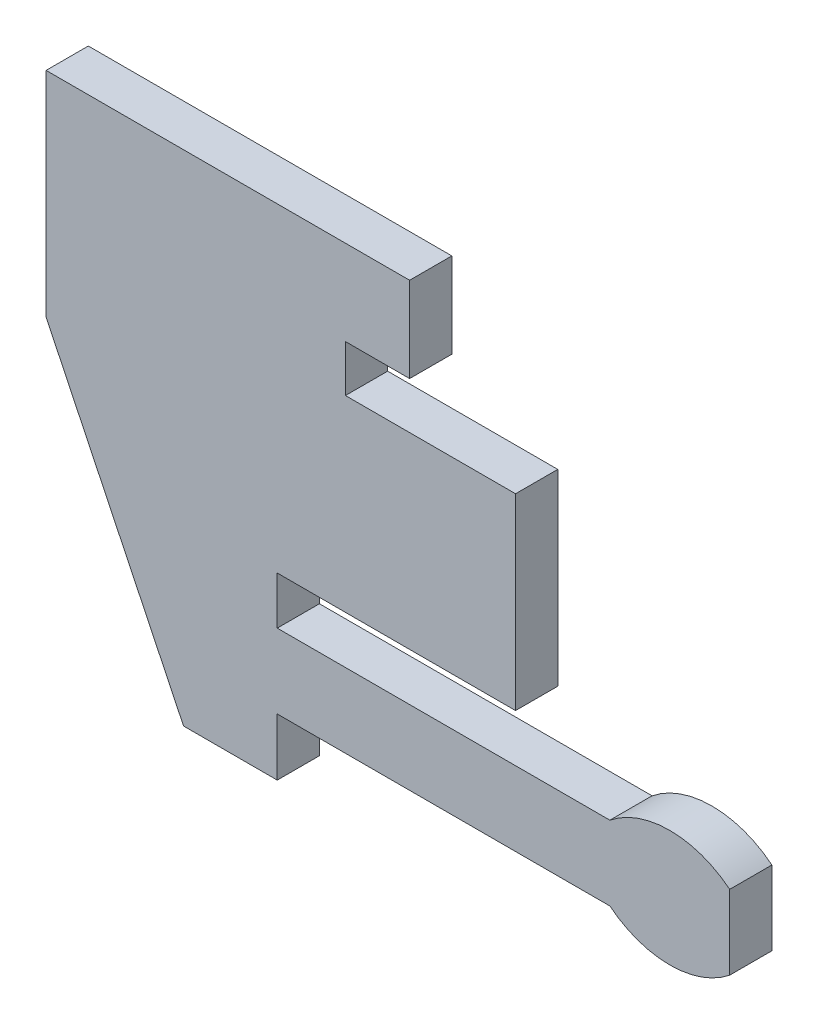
ISO-10303-21;
HEADER;
FILE_DESCRIPTION(('STEP AP214'),'2;1');
FILE_NAME('part.step','',(''),(''),'','','');
FILE_SCHEMA(('AUTOMOTIVE_DESIGN { 1 0 10303 214 1 1 1 1 }'));
ENDSEC;
DATA;
#1=APPLICATION_CONTEXT('core data for automotive mechanical design processes');
#2=APPLICATION_PROTOCOL_DEFINITION('international standard','automotive_design',2000,#1);
#3=PRODUCT_CONTEXT('',#1,'mechanical');
#4=PRODUCT('Part','Part','',(#3));
#5=PRODUCT_RELATED_PRODUCT_CATEGORY('part','',(#4));
#6=PRODUCT_DEFINITION_FORMATION('','',#4);
#7=PRODUCT_DEFINITION_CONTEXT('part definition',#1,'design');
#8=PRODUCT_DEFINITION('design','',#6,#7);
#9=PRODUCT_DEFINITION_SHAPE('','',#8);
#10=(LENGTH_UNIT() NAMED_UNIT(*) SI_UNIT(.MILLI.,.METRE.));
#11=(NAMED_UNIT(*) PLANE_ANGLE_UNIT() SI_UNIT($,.RADIAN.));
#12=(NAMED_UNIT(*) SI_UNIT($,.STERADIAN.) SOLID_ANGLE_UNIT());
#13=UNCERTAINTY_MEASURE_WITH_UNIT(LENGTH_MEASURE(1.E-05),#10,'distance_accuracy_value','');
#14=(GEOMETRIC_REPRESENTATION_CONTEXT(3) GLOBAL_UNCERTAINTY_ASSIGNED_CONTEXT((#13)) GLOBAL_UNIT_ASSIGNED_CONTEXT((#10,
#11,#12)) REPRESENTATION_CONTEXT('',''));
#15=CARTESIAN_POINT('',(0.,0.,0.));
#16=DIRECTION('',(0.,0.,1.));
#17=DIRECTION('',(1.,0.,0.));
#18=AXIS2_PLACEMENT_3D('',#15,#16,#17);
#19=CARTESIAN_POINT('',(-6.49853117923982,0.164170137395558,1.524));
#20=DIRECTION('',(0.,1.,0.));
#21=DIRECTION('',(0.,0.,1.));
#22=AXIS2_PLACEMENT_3D('',#19,#20,#21);
#23=PLANE('',#22);
#24=DIRECTION('',(1.,0.,0.));
#25=VECTOR('',#24,1.);
#26=CARTESIAN_POINT('',(-6.49853117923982,0.164170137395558,0.));
#27=LINE('',#26,#25);
#28=CARTESIAN_POINT('',(-8.81542456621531,0.164170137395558,0.));
#29=VERTEX_POINT('',#28);
#30=CARTESIAN_POINT('',(-6.49853117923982,0.164170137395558,0.));
#31=VERTEX_POINT('',#30);
#32=EDGE_CURVE('E186',#29,#31,#27,.T.);
#33=ORIENTED_EDGE('',*,*,#32,.T.);
#34=DIRECTION('',(0.,0.,-1.));
#35=VECTOR('',#34,1.);
#36=CARTESIAN_POINT('',(-6.49853117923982,0.164170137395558,1.524));
#37=LINE('',#36,#35);
#38=CARTESIAN_POINT('',(-6.49853117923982,0.164170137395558,1.524));
#39=VERTEX_POINT('',#38);
#40=EDGE_CURVE('E11',#39,#31,#37,.T.);
#41=ORIENTED_EDGE('',*,*,#40,.F.);
#42=DIRECTION('',(1.,0.,0.));
#43=VECTOR('',#42,1.);
#44=CARTESIAN_POINT('',(-6.49853117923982,0.164170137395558,1.524));
#45=LINE('',#44,#43);
#46=CARTESIAN_POINT('',(-8.81542456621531,0.164170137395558,1.524));
#47=VERTEX_POINT('',#46);
#48=EDGE_CURVE('E218',#47,#39,#45,.T.);
#49=ORIENTED_EDGE('',*,*,#48,.F.);
#50=DIRECTION('',(0.,0.,-1.));
#51=VECTOR('',#50,1.);
#52=CARTESIAN_POINT('',(-8.81542456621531,0.164170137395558,1.524));
#53=LINE('',#52,#51);
#54=EDGE_CURVE('E182',#47,#29,#53,.T.);
#55=ORIENTED_EDGE('',*,*,#54,.T.);
#56=EDGE_LOOP('',(#33,#41,#49,#55));
#57=FACE_BOUND('',#56,.T.);
#58=ADVANCED_FACE('F36',(#57),#23,.F.);
#59=CARTESIAN_POINT('',(-6.49853117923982,3.2394890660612,1.524));
#60=DIRECTION('',(-1.,0.,0.));
#61=DIRECTION('',(0.,0.,1.));
#62=AXIS2_PLACEMENT_3D('',#59,#60,#61);
#63=PLANE('',#62);
#64=DIRECTION('',(0.,1.,0.));
#65=VECTOR('',#64,1.);
#66=CARTESIAN_POINT('',(-6.49853117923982,3.2394890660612,0.));
#67=LINE('',#66,#65);
#68=CARTESIAN_POINT('',(-6.49853117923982,3.2394890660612,0.));
#69=VERTEX_POINT('',#68);
#70=EDGE_CURVE('E189',#31,#69,#67,.T.);
#71=ORIENTED_EDGE('',*,*,#70,.T.);
#72=DIRECTION('',(0.,0.,-1.));
#73=VECTOR('',#72,1.);
#74=CARTESIAN_POINT('',(-6.49853117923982,3.2394890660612,1.524));
#75=LINE('',#74,#73);
#76=CARTESIAN_POINT('',(-6.49853117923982,3.2394890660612,1.524));
#77=VERTEX_POINT('',#76);
#78=EDGE_CURVE('E44',#77,#69,#75,.T.);
#79=ORIENTED_EDGE('',*,*,#78,.F.);
#80=DIRECTION('',(0.,1.,0.));
#81=VECTOR('',#80,1.);
#82=CARTESIAN_POINT('',(-6.49853117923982,3.2394890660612,1.524));
#83=LINE('',#82,#81);
#84=EDGE_CURVE('E122',#39,#77,#83,.T.);
#85=ORIENTED_EDGE('',*,*,#84,.F.);
#86=ORIENTED_EDGE('',*,*,#40,.T.);
#87=EDGE_LOOP('',(#71,#79,#85,#86));
#88=FACE_BOUND('',#87,.T.);
#89=ADVANCED_FACE('F321',(#88),#63,.F.);
#90=CARTESIAN_POINT('',(-19.6239910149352,3.2394890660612,1.524));
#91=DIRECTION('',(0.,-1.,0.));
#92=DIRECTION('',(0.,0.,-1.));
#93=AXIS2_PLACEMENT_3D('',#90,#91,#92);
#94=PLANE('',#93);
#95=DIRECTION('',(-1.,0.,0.));
#96=VECTOR('',#95,1.);
#97=CARTESIAN_POINT('',(-19.6239910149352,3.2394890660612,0.));
#98=LINE('',#97,#96);
#99=CARTESIAN_POINT('',(-19.6239910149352,3.2394890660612,0.));
#100=VERTEX_POINT('',#99);
#101=EDGE_CURVE('E191',#69,#100,#98,.T.);
#102=ORIENTED_EDGE('',*,*,#101,.T.);
#103=DIRECTION('',(0.,0.,-1.));
#104=VECTOR('',#103,1.);
#105=CARTESIAN_POINT('',(-19.6239910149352,3.2394890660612,1.524));
#106=LINE('',#105,#104);
#107=CARTESIAN_POINT('',(-19.6239910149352,3.2394890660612,1.524));
#108=VERTEX_POINT('',#107);
#109=EDGE_CURVE('E252',#108,#100,#106,.T.);
#110=ORIENTED_EDGE('',*,*,#109,.F.);
#111=DIRECTION('',(-1.,0.,0.));
#112=VECTOR('',#111,1.);
#113=CARTESIAN_POINT('',(-19.6239910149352,3.2394890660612,1.524));
#114=LINE('',#113,#112);
#115=EDGE_CURVE('E260',#77,#108,#114,.T.);
#116=ORIENTED_EDGE('',*,*,#115,.F.);
#117=ORIENTED_EDGE('',*,*,#78,.T.);
#118=EDGE_LOOP('',(#102,#110,#116,#117));
#119=FACE_BOUND('',#118,.T.);
#120=ADVANCED_FACE('F258',(#119),#94,.F.);
#121=CARTESIAN_POINT('',(-19.6239910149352,-4.47575270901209,1.524));
#122=DIRECTION('',(1.,0.,0.));
#123=DIRECTION('',(0.,0.,-1.));
#124=AXIS2_PLACEMENT_3D('',#121,#122,#123);
#125=PLANE('',#124);
#126=DIRECTION('',(0.,-1.,0.));
#127=VECTOR('',#126,1.);
#128=CARTESIAN_POINT('',(-19.6239910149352,-4.47575270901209,0.));
#129=LINE('',#128,#127);
#130=CARTESIAN_POINT('',(-19.6239910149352,-4.47575270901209,0.));
#131=VERTEX_POINT('',#130);
#132=EDGE_CURVE('E193',#100,#131,#129,.T.);
#133=ORIENTED_EDGE('',*,*,#132,.T.);
#134=DIRECTION('',(0.,0.,-1.));
#135=VECTOR('',#134,1.);
#136=CARTESIAN_POINT('',(-19.6239910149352,-4.47575270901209,1.524));
#137=LINE('',#136,#135);
#138=CARTESIAN_POINT('',(-19.6239910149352,-4.47575270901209,1.524));
#139=VERTEX_POINT('',#138);
#140=EDGE_CURVE('E249',#139,#131,#137,.T.);
#141=ORIENTED_EDGE('',*,*,#140,.F.);
#142=DIRECTION('',(0.,-1.,0.));
#143=VECTOR('',#142,1.);
#144=CARTESIAN_POINT('',(-19.6239910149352,-4.47575270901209,1.524));
#145=LINE('',#144,#143);
#146=EDGE_CURVE('E278',#108,#139,#145,.T.);
#147=ORIENTED_EDGE('',*,*,#146,.F.);
#148=ORIENTED_EDGE('',*,*,#109,.T.);
#149=EDGE_LOOP('',(#133,#141,#147,#148));
#150=FACE_BOUND('',#149,.T.);
#151=ADVANCED_FACE('F269',(#150),#125,.F.);
#152=CARTESIAN_POINT('',(-14.6613021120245,-14.7809780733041,1.524));
#153=DIRECTION('',(0.900970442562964,0.433880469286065,0.));
#154=DIRECTION('',(-0.433880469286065,0.900970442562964,0.));
#155=AXIS2_PLACEMENT_3D('',#152,#153,#154);
#156=PLANE('',#155);
#157=DIRECTION('',(0.433880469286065,-0.900970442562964,0.));
#158=VECTOR('',#157,1.);
#159=CARTESIAN_POINT('',(-14.6613021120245,-14.7809780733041,0.));
#160=LINE('',#159,#158);
#161=CARTESIAN_POINT('',(-14.6613021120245,-14.7809780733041,0.));
#162=VERTEX_POINT('',#161);
#163=EDGE_CURVE('E195',#131,#162,#160,.T.);
#164=ORIENTED_EDGE('',*,*,#163,.T.);
#165=DIRECTION('',(0.,0.,-1.));
#166=VECTOR('',#165,1.);
#167=CARTESIAN_POINT('',(-14.6613021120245,-14.7809780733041,1.524));
#168=LINE('',#167,#166);
#169=CARTESIAN_POINT('',(-14.6613021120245,-14.7809780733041,1.524));
#170=VERTEX_POINT('',#169);
#171=EDGE_CURVE('E246',#170,#162,#168,.T.);
#172=ORIENTED_EDGE('',*,*,#171,.F.);
#173=DIRECTION('',(0.433880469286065,-0.900970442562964,0.));
#174=VECTOR('',#173,1.);
#175=CARTESIAN_POINT('',(-14.6613021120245,-14.7809780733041,1.524));
#176=LINE('',#175,#174);
#177=EDGE_CURVE('E275',#139,#170,#176,.T.);
#178=ORIENTED_EDGE('',*,*,#177,.F.);
#179=ORIENTED_EDGE('',*,*,#140,.T.);
#180=EDGE_LOOP('',(#164,#172,#178,#179));
#181=FACE_BOUND('',#180,.T.);
#182=ADVANCED_FACE('F273',(#181),#156,.F.);
#183=CARTESIAN_POINT('',(-11.2779648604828,-14.7809780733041,1.524));
#184=DIRECTION('',(0.,1.,0.));
#185=DIRECTION('',(0.,0.,1.));
#186=AXIS2_PLACEMENT_3D('',#183,#184,#185);
#187=PLANE('',#186);
#188=DIRECTION('',(1.,0.,0.));
#189=VECTOR('',#188,1.);
#190=CARTESIAN_POINT('',(-11.2779648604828,-14.7809780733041,0.));
#191=LINE('',#190,#189);
#192=CARTESIAN_POINT('',(-11.2779648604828,-14.7809780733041,0.));
#193=VERTEX_POINT('',#192);
#194=EDGE_CURVE('E197',#162,#193,#191,.T.);
#195=ORIENTED_EDGE('',*,*,#194,.T.);
#196=DIRECTION('',(0.,0.,-1.));
#197=VECTOR('',#196,1.);
#198=CARTESIAN_POINT('',(-11.2779648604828,-14.7809780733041,1.524));
#199=LINE('',#198,#197);
#200=CARTESIAN_POINT('',(-11.2779648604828,-14.7809780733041,1.524));
#201=VERTEX_POINT('',#200);
#202=EDGE_CURVE('E243',#201,#193,#199,.T.);
#203=ORIENTED_EDGE('',*,*,#202,.F.);
#204=DIRECTION('',(1.,0.,0.));
#205=VECTOR('',#204,1.);
#206=CARTESIAN_POINT('',(-11.2779648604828,-14.7809780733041,1.524));
#207=LINE('',#206,#205);
#208=EDGE_CURVE('E277',#170,#201,#207,.T.);
#209=ORIENTED_EDGE('',*,*,#208,.F.);
#210=ORIENTED_EDGE('',*,*,#171,.T.);
#211=EDGE_LOOP('',(#195,#203,#209,#210));
#212=FACE_BOUND('',#211,.T.);
#213=ADVANCED_FACE('F334',(#212),#187,.F.);
#214=CARTESIAN_POINT('',(-11.2779648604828,-12.7117809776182,1.524));
#215=DIRECTION('',(-1.,0.,0.));
#216=DIRECTION('',(0.,0.,1.));
#217=AXIS2_PLACEMENT_3D('',#214,#215,#216);
#218=PLANE('',#217);
#219=DIRECTION('',(0.,1.,0.));
#220=VECTOR('',#219,1.);
#221=CARTESIAN_POINT('',(-11.2779648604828,-12.7117809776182,0.));
#222=LINE('',#221,#220);
#223=CARTESIAN_POINT('',(-11.2779648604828,-12.7117809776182,0.));
#224=VERTEX_POINT('',#223);
#225=EDGE_CURVE('E199',#193,#224,#222,.T.);
#226=ORIENTED_EDGE('',*,*,#225,.T.);
#227=DIRECTION('',(0.,0.,-1.));
#228=VECTOR('',#227,1.);
#229=CARTESIAN_POINT('',(-11.2779648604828,-12.7117809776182,1.524));
#230=LINE('',#229,#228);
#231=CARTESIAN_POINT('',(-11.2779648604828,-12.7117809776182,1.524));
#232=VERTEX_POINT('',#231);
#233=EDGE_CURVE('E240',#232,#224,#230,.T.);
#234=ORIENTED_EDGE('',*,*,#233,.F.);
#235=DIRECTION('',(0.,1.,0.));
#236=VECTOR('',#235,1.);
#237=CARTESIAN_POINT('',(-11.2779648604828,-12.7117809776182,1.524));
#238=LINE('',#237,#236);
#239=EDGE_CURVE('E280',#201,#232,#238,.T.);
#240=ORIENTED_EDGE('',*,*,#239,.F.);
#241=ORIENTED_EDGE('',*,*,#202,.T.);
#242=EDGE_LOOP('',(#226,#234,#240,#241));
#243=FACE_BOUND('',#242,.T.);
#244=ADVANCED_FACE('F337',(#243),#218,.F.);
#245=CARTESIAN_POINT('',(0.731715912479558,-12.7117809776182,1.524));
#246=DIRECTION('',(0.,1.,0.));
#247=DIRECTION('',(0.,0.,1.));
#248=AXIS2_PLACEMENT_3D('',#245,#246,#247);
#249=PLANE('',#248);
#250=DIRECTION('',(1.,0.,0.));
#251=VECTOR('',#250,1.);
#252=CARTESIAN_POINT('',(0.731715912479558,-12.7117809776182,0.));
#253=LINE('',#252,#251);
#254=CARTESIAN_POINT('',(0.731715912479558,-12.7117809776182,0.));
#255=VERTEX_POINT('',#254);
#256=EDGE_CURVE('E201',#224,#255,#253,.T.);
#257=ORIENTED_EDGE('',*,*,#256,.T.);
#258=DIRECTION('',(0.,0.,-1.));
#259=VECTOR('',#258,1.);
#260=CARTESIAN_POINT('',(0.731715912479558,-12.7117809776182,1.524));
#261=LINE('',#260,#259);
#262=CARTESIAN_POINT('',(0.731715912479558,-12.7117809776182,1.524));
#263=VERTEX_POINT('',#262);
#264=EDGE_CURVE('E237',#263,#255,#261,.T.);
#265=ORIENTED_EDGE('',*,*,#264,.F.);
#266=DIRECTION('',(1.,0.,0.));
#267=VECTOR('',#266,1.);
#268=CARTESIAN_POINT('',(0.731715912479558,-12.7117809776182,1.524));
#269=LINE('',#268,#267);
#270=EDGE_CURVE('E286',#232,#263,#269,.T.);
#271=ORIENTED_EDGE('',*,*,#270,.F.);
#272=ORIENTED_EDGE('',*,*,#233,.T.);
#273=EDGE_LOOP('',(#257,#265,#271,#272));
#274=FACE_BOUND('',#273,.T.);
#275=ADVANCED_FACE('F341',(#274),#249,.F.);
#276=CARTESIAN_POINT('',(2.89511691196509,-10.0282288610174,1.524));
#277=DIRECTION('',(0.,0.,-1.));
#278=DIRECTION('',(-1.,0.,0.));
#279=AXIS2_PLACEMENT_3D('',#276,#277,#278);
#280=CYLINDRICAL_SURFACE('',#279,3.44699228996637);
#281=CARTESIAN_POINT('',(2.89511691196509,-10.0282288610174,0.));
#282=DIRECTION('',(0.,0.,1.));
#283=DIRECTION('',(1.,0.,0.));
#284=AXIS2_PLACEMENT_3D('',#281,#282,#283);
#285=CIRCLE('',#284,3.44699228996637);
#286=CARTESIAN_POINT('',(5.05851791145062,-12.7117809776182,0.));
#287=VERTEX_POINT('',#286);
#288=EDGE_CURVE('E203',#255,#287,#285,.T.);
#289=ORIENTED_EDGE('',*,*,#288,.T.);
#290=DIRECTION('',(0.,0.,-1.));
#291=VECTOR('',#290,1.);
#292=CARTESIAN_POINT('',(5.05851791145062,-12.7117809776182,1.524));
#293=LINE('',#292,#291);
#294=CARTESIAN_POINT('',(5.05851791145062,-12.7117809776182,1.524));
#295=VERTEX_POINT('',#294);
#296=EDGE_CURVE('E234',#295,#287,#293,.T.);
#297=ORIENTED_EDGE('',*,*,#296,.F.);
#298=CARTESIAN_POINT('',(2.89511691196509,-10.0282288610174,1.524));
#299=DIRECTION('',(0.,0.,1.));
#300=DIRECTION('',(1.,0.,0.));
#301=AXIS2_PLACEMENT_3D('',#298,#299,#300);
#302=CIRCLE('',#301,3.44699228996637);
#303=EDGE_CURVE('E288',#263,#295,#302,.T.);
#304=ORIENTED_EDGE('',*,*,#303,.F.);
#305=ORIENTED_EDGE('',*,*,#264,.T.);
#306=EDGE_LOOP('',(#289,#297,#304,#305));
#307=FACE_BOUND('',#306,.T.);
#308=ADVANCED_FACE('F345',(#307),#280,.T.);
#309=CARTESIAN_POINT('',(5.05851791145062,-10.0282288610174,1.524));
#310=DIRECTION('',(-1.,0.,0.));
#311=DIRECTION('',(0.,0.,1.));
#312=AXIS2_PLACEMENT_3D('',#309,#310,#311);
#313=PLANE('',#312);
#314=DIRECTION('',(0.,1.,0.));
#315=VECTOR('',#314,1.);
#316=CARTESIAN_POINT('',(5.05851791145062,-10.0282288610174,0.));
#317=LINE('',#316,#315);
#318=CARTESIAN_POINT('',(5.05851791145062,-10.0282288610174,0.));
#319=VERTEX_POINT('',#318);
#320=EDGE_CURVE('E205',#287,#319,#317,.T.);
#321=ORIENTED_EDGE('',*,*,#320,.T.);
#322=DIRECTION('',(0.,0.,-1.));
#323=VECTOR('',#322,1.);
#324=CARTESIAN_POINT('',(5.05851791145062,-10.0282288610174,1.524));
#325=LINE('',#324,#323);
#326=CARTESIAN_POINT('',(5.05851791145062,-10.0282288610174,1.524));
#327=VERTEX_POINT('',#326);
#328=EDGE_CURVE('E231',#327,#319,#325,.T.);
#329=ORIENTED_EDGE('',*,*,#328,.F.);
#330=DIRECTION('',(0.,1.,0.));
#331=VECTOR('',#330,1.);
#332=CARTESIAN_POINT('',(5.05851791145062,-10.0282288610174,1.524));
#333=LINE('',#332,#331);
#334=EDGE_CURVE('E290',#295,#327,#333,.T.);
#335=ORIENTED_EDGE('',*,*,#334,.F.);
#336=ORIENTED_EDGE('',*,*,#296,.T.);
#337=EDGE_LOOP('',(#321,#329,#335,#336));
#338=FACE_BOUND('',#337,.T.);
#339=ADVANCED_FACE('F349',(#338),#313,.F.);
#340=CARTESIAN_POINT('',(2.89511691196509,-12.7117809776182,1.524));
#341=DIRECTION('',(0.,0.,-1.));
#342=DIRECTION('',(-1.,0.,0.));
#343=AXIS2_PLACEMENT_3D('',#340,#341,#342);
#344=CYLINDRICAL_SURFACE('',#343,3.44699228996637);
#345=CARTESIAN_POINT('',(2.89511691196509,-12.7117809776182,0.));
#346=DIRECTION('',(0.,0.,1.));
#347=DIRECTION('',(-1.,0.,0.));
#348=AXIS2_PLACEMENT_3D('',#345,#346,#347);
#349=CIRCLE('',#348,3.44699228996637);
#350=CARTESIAN_POINT('',(0.731715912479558,-10.0282288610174,0.));
#351=VERTEX_POINT('',#350);
#352=EDGE_CURVE('E207',#319,#351,#349,.T.);
#353=ORIENTED_EDGE('',*,*,#352,.T.);
#354=DIRECTION('',(0.,0.,-1.));
#355=VECTOR('',#354,1.);
#356=CARTESIAN_POINT('',(0.731715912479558,-10.0282288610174,1.524));
#357=LINE('',#356,#355);
#358=CARTESIAN_POINT('',(0.731715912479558,-10.0282288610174,1.524));
#359=VERTEX_POINT('',#358);
#360=EDGE_CURVE('E228',#359,#351,#357,.T.);
#361=ORIENTED_EDGE('',*,*,#360,.F.);
#362=CARTESIAN_POINT('',(2.89511691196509,-12.7117809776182,1.524));
#363=DIRECTION('',(0.,0.,1.));
#364=DIRECTION('',(-1.,0.,0.));
#365=AXIS2_PLACEMENT_3D('',#362,#363,#364);
#366=CIRCLE('',#365,3.44699228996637);
#367=EDGE_CURVE('E292',#327,#359,#366,.T.);
#368=ORIENTED_EDGE('',*,*,#367,.F.);
#369=ORIENTED_EDGE('',*,*,#328,.T.);
#370=EDGE_LOOP('',(#353,#361,#368,#369));
#371=FACE_BOUND('',#370,.T.);
#372=ADVANCED_FACE('F353',(#371),#344,.T.);
#373=CARTESIAN_POINT('',(-11.2779648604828,-10.0282288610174,1.524));
#374=DIRECTION('',(0.,-1.,0.));
#375=DIRECTION('',(0.,0.,-1.));
#376=AXIS2_PLACEMENT_3D('',#373,#374,#375);
#377=PLANE('',#376);
#378=DIRECTION('',(-1.,0.,0.));
#379=VECTOR('',#378,1.);
#380=CARTESIAN_POINT('',(-11.2779648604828,-10.0282288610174,0.));
#381=LINE('',#380,#379);
#382=CARTESIAN_POINT('',(-11.2779648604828,-10.0282288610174,0.));
#383=VERTEX_POINT('',#382);
#384=EDGE_CURVE('E209',#351,#383,#381,.T.);
#385=ORIENTED_EDGE('',*,*,#384,.T.);
#386=DIRECTION('',(0.,0.,-1.));
#387=VECTOR('',#386,1.);
#388=CARTESIAN_POINT('',(-11.2779648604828,-10.0282288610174,1.524));
#389=LINE('',#388,#387);
#390=CARTESIAN_POINT('',(-11.2779648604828,-10.0282288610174,1.524));
#391=VERTEX_POINT('',#390);
#392=EDGE_CURVE('E225',#391,#383,#389,.T.);
#393=ORIENTED_EDGE('',*,*,#392,.F.);
#394=DIRECTION('',(-1.,0.,0.));
#395=VECTOR('',#394,1.);
#396=CARTESIAN_POINT('',(-11.2779648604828,-10.0282288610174,1.524));
#397=LINE('',#396,#395);
#398=EDGE_CURVE('E294',#359,#391,#397,.T.);
#399=ORIENTED_EDGE('',*,*,#398,.F.);
#400=ORIENTED_EDGE('',*,*,#360,.T.);
#401=EDGE_LOOP('',(#385,#393,#399,#400));
#402=FACE_BOUND('',#401,.T.);
#403=ADVANCED_FACE('F357',(#402),#377,.F.);
#404=CARTESIAN_POINT('',(-11.2779648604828,-8.30446747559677,1.524));
#405=DIRECTION('',(-1.,0.,0.));
#406=DIRECTION('',(0.,0.,1.));
#407=AXIS2_PLACEMENT_3D('',#404,#405,#406);
#408=PLANE('',#407);
#409=DIRECTION('',(0.,1.,0.));
#410=VECTOR('',#409,1.);
#411=CARTESIAN_POINT('',(-11.2779648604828,-8.30446747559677,0.));
#412=LINE('',#411,#410);
#413=CARTESIAN_POINT('',(-11.2779648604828,-8.30446747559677,0.));
#414=VERTEX_POINT('',#413);
#415=EDGE_CURVE('E211',#383,#414,#412,.T.);
#416=ORIENTED_EDGE('',*,*,#415,.T.);
#417=DIRECTION('',(0.,0.,-1.));
#418=VECTOR('',#417,1.);
#419=CARTESIAN_POINT('',(-11.2779648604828,-8.30446747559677,1.524));
#420=LINE('',#419,#418);
#421=CARTESIAN_POINT('',(-11.2779648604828,-8.30446747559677,1.524));
#422=VERTEX_POINT('',#421);
#423=EDGE_CURVE('E222',#422,#414,#420,.T.);
#424=ORIENTED_EDGE('',*,*,#423,.F.);
#425=DIRECTION('',(0.,1.,0.));
#426=VECTOR('',#425,1.);
#427=CARTESIAN_POINT('',(-11.2779648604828,-8.30446747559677,1.524));
#428=LINE('',#427,#426);
#429=EDGE_CURVE('E296',#391,#422,#428,.T.);
#430=ORIENTED_EDGE('',*,*,#429,.F.);
#431=ORIENTED_EDGE('',*,*,#392,.T.);
#432=EDGE_LOOP('',(#416,#424,#430,#431));
#433=FACE_BOUND('',#432,.T.);
#434=ADVANCED_FACE('F302',(#433),#408,.F.);
#435=CARTESIAN_POINT('',(-2.67343798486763,-8.30446747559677,1.524));
#436=DIRECTION('',(0.,1.,0.));
#437=DIRECTION('',(-1.,0.,0.));
#438=AXIS2_PLACEMENT_3D('',#435,#436,#437);
#439=PLANE('',#438);
#440=DIRECTION('',(1.,0.,0.));
#441=VECTOR('',#440,1.);
#442=CARTESIAN_POINT('',(-2.67343798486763,-8.30446747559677,0.));
#443=LINE('',#442,#441);
#444=CARTESIAN_POINT('',(-2.67343798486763,-8.30446747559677,0.));
#445=VERTEX_POINT('',#444);
#446=EDGE_CURVE('E213',#414,#445,#443,.T.);
#447=ORIENTED_EDGE('',*,*,#446,.T.);
#448=DIRECTION('',(0.,0.,-1.));
#449=VECTOR('',#448,1.);
#450=CARTESIAN_POINT('',(-2.67343798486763,-8.30446747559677,1.524));
#451=LINE('',#450,#449);
#452=CARTESIAN_POINT('',(-2.67343798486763,-8.30446747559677,1.524));
#453=VERTEX_POINT('',#452);
#454=EDGE_CURVE('E177',#453,#445,#451,.T.);
#455=ORIENTED_EDGE('',*,*,#454,.F.);
#456=DIRECTION('',(1.,0.,0.));
#457=VECTOR('',#456,1.);
#458=CARTESIAN_POINT('',(-2.67343798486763,-8.30446747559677,1.524));
#459=LINE('',#458,#457);
#460=EDGE_CURVE('E168',#422,#453,#459,.T.);
#461=ORIENTED_EDGE('',*,*,#460,.F.);
#462=ORIENTED_EDGE('',*,*,#423,.T.);
#463=EDGE_LOOP('',(#447,#455,#461,#462));
#464=FACE_BOUND('',#463,.T.);
#465=ADVANCED_FACE('F306',(#464),#439,.F.);
#466=CARTESIAN_POINT('',(-2.67343798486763,-1.52400000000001,1.524));
#467=DIRECTION('',(-1.,0.,0.));
#468=DIRECTION('',(0.,0.,1.));
#469=AXIS2_PLACEMENT_3D('',#466,#467,#468);
#470=PLANE('',#469);
#471=DIRECTION('',(0.,1.,0.));
#472=VECTOR('',#471,1.);
#473=CARTESIAN_POINT('',(-2.67343798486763,-1.52400000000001,0.));
#474=LINE('',#473,#472);
#475=CARTESIAN_POINT('',(-2.67343798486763,-1.52400000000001,0.));
#476=VERTEX_POINT('',#475);
#477=EDGE_CURVE('E176',#445,#476,#474,.T.);
#478=ORIENTED_EDGE('',*,*,#477,.T.);
#479=DIRECTION('',(0.,0.,-1.));
#480=VECTOR('',#479,1.);
#481=CARTESIAN_POINT('',(-2.67343798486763,-1.52400000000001,1.524));
#482=LINE('',#481,#480);
#483=CARTESIAN_POINT('',(-2.67343798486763,-1.52400000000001,1.524));
#484=VERTEX_POINT('',#483);
#485=EDGE_CURVE('E173',#484,#476,#482,.T.);
#486=ORIENTED_EDGE('',*,*,#485,.F.);
#487=DIRECTION('',(0.,1.,0.));
#488=VECTOR('',#487,1.);
#489=CARTESIAN_POINT('',(-2.67343798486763,-1.52400000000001,1.524));
#490=LINE('',#489,#488);
#491=EDGE_CURVE('E162',#453,#484,#490,.T.);
#492=ORIENTED_EDGE('',*,*,#491,.F.);
#493=ORIENTED_EDGE('',*,*,#454,.T.);
#494=EDGE_LOOP('',(#478,#486,#492,#493));
#495=FACE_BOUND('',#494,.T.);
#496=ADVANCED_FACE('F174',(#495),#470,.F.);
#497=CARTESIAN_POINT('',(-8.81542456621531,-1.52400000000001,1.524));
#498=DIRECTION('',(0.,-1.,0.));
#499=DIRECTION('',(0.,0.,-1.));
#500=AXIS2_PLACEMENT_3D('',#497,#498,#499);
#501=PLANE('',#500);
#502=DIRECTION('',(-1.,0.,0.));
#503=VECTOR('',#502,1.);
#504=CARTESIAN_POINT('',(-8.81542456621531,-1.52400000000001,0.));
#505=LINE('',#504,#503);
#506=CARTESIAN_POINT('',(-8.81542456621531,-1.52400000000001,0.));
#507=VERTEX_POINT('',#506);
#508=EDGE_CURVE('E108',#476,#507,#505,.T.);
#509=ORIENTED_EDGE('',*,*,#508,.T.);
#510=DIRECTION('',(0.,0.,-1.));
#511=VECTOR('',#510,1.);
#512=CARTESIAN_POINT('',(-8.81542456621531,-1.52400000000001,1.524));
#513=LINE('',#512,#511);
#514=CARTESIAN_POINT('',(-8.81542456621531,-1.52400000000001,1.524));
#515=VERTEX_POINT('',#514);
#516=EDGE_CURVE('E178',#515,#507,#513,.T.);
#517=ORIENTED_EDGE('',*,*,#516,.F.);
#518=DIRECTION('',(-1.,0.,0.));
#519=VECTOR('',#518,1.);
#520=CARTESIAN_POINT('',(-8.81542456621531,-1.52400000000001,1.524));
#521=LINE('',#520,#519);
#522=EDGE_CURVE('E166',#484,#515,#521,.T.);
#523=ORIENTED_EDGE('',*,*,#522,.F.);
#524=ORIENTED_EDGE('',*,*,#485,.T.);
#525=EDGE_LOOP('',(#509,#517,#523,#524));
#526=FACE_BOUND('',#525,.T.);
#527=ADVANCED_FACE('F180',(#526),#501,.F.);
#528=CARTESIAN_POINT('',(-8.81542456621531,0.164170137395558,1.524));
#529=DIRECTION('',(-1.,0.,0.));
#530=DIRECTION('',(0.,0.,1.));
#531=AXIS2_PLACEMENT_3D('',#528,#529,#530);
#532=PLANE('',#531);
#533=DIRECTION('',(0.,1.,0.));
#534=VECTOR('',#533,1.);
#535=CARTESIAN_POINT('',(-8.81542456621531,0.164170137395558,0.));
#536=LINE('',#535,#534);
#537=EDGE_CURVE('E114',#507,#29,#536,.T.);
#538=ORIENTED_EDGE('',*,*,#537,.T.);
#539=ORIENTED_EDGE('',*,*,#54,.F.);
#540=DIRECTION('',(0.,1.,0.));
#541=VECTOR('',#540,1.);
#542=CARTESIAN_POINT('',(-8.81542456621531,0.164170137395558,1.524));
#543=LINE('',#542,#541);
#544=EDGE_CURVE('E52',#515,#47,#543,.T.);
#545=ORIENTED_EDGE('',*,*,#544,.F.);
#546=ORIENTED_EDGE('',*,*,#516,.T.);
#547=EDGE_LOOP('',(#538,#539,#545,#546));
#548=FACE_BOUND('',#547,.T.);
#549=ADVANCED_FACE('F310',(#548),#532,.F.);
#550=CARTESIAN_POINT('',(2.89511691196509,-12.7117809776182,1.524));
#551=DIRECTION('',(0.,0.,-1.));
#552=DIRECTION('',(-1.,0.,0.));
#553=AXIS2_PLACEMENT_3D('',#550,#551,#552);
#554=PLANE('',#553);
#555=ORIENTED_EDGE('',*,*,#48,.T.);
#556=ORIENTED_EDGE('',*,*,#84,.T.);
#557=ORIENTED_EDGE('',*,*,#115,.T.);
#558=ORIENTED_EDGE('',*,*,#146,.T.);
#559=ORIENTED_EDGE('',*,*,#177,.T.);
#560=ORIENTED_EDGE('',*,*,#208,.T.);
#561=ORIENTED_EDGE('',*,*,#239,.T.);
#562=ORIENTED_EDGE('',*,*,#270,.T.);
#563=ORIENTED_EDGE('',*,*,#303,.T.);
#564=ORIENTED_EDGE('',*,*,#334,.T.);
#565=ORIENTED_EDGE('',*,*,#367,.T.);
#566=ORIENTED_EDGE('',*,*,#398,.T.);
#567=ORIENTED_EDGE('',*,*,#429,.T.);
#568=ORIENTED_EDGE('',*,*,#460,.T.);
#569=ORIENTED_EDGE('',*,*,#491,.T.);
#570=ORIENTED_EDGE('',*,*,#522,.T.);
#571=ORIENTED_EDGE('',*,*,#544,.T.);
#572=EDGE_LOOP('',(#555,#556,#557,#558,#559,#560,#561,#562,#563,#564,#565,#566,#567,#568,#569,
#570,#571));
#573=FACE_BOUND('',#572,.T.);
#574=ADVANCED_FACE('F164',(#573),#554,.F.);
#575=CARTESIAN_POINT('',(2.89511691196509,-12.7117809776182,0.));
#576=DIRECTION('',(0.,0.,-1.));
#577=DIRECTION('',(-1.,0.,0.));
#578=AXIS2_PLACEMENT_3D('',#575,#576,#577);
#579=PLANE('',#578);
#580=ORIENTED_EDGE('',*,*,#32,.F.);
#581=ORIENTED_EDGE('',*,*,#537,.F.);
#582=ORIENTED_EDGE('',*,*,#508,.F.);
#583=ORIENTED_EDGE('',*,*,#477,.F.);
#584=ORIENTED_EDGE('',*,*,#446,.F.);
#585=ORIENTED_EDGE('',*,*,#415,.F.);
#586=ORIENTED_EDGE('',*,*,#384,.F.);
#587=ORIENTED_EDGE('',*,*,#352,.F.);
#588=ORIENTED_EDGE('',*,*,#320,.F.);
#589=ORIENTED_EDGE('',*,*,#288,.F.);
#590=ORIENTED_EDGE('',*,*,#256,.F.);
#591=ORIENTED_EDGE('',*,*,#225,.F.);
#592=ORIENTED_EDGE('',*,*,#194,.F.);
#593=ORIENTED_EDGE('',*,*,#163,.F.);
#594=ORIENTED_EDGE('',*,*,#132,.F.);
#595=ORIENTED_EDGE('',*,*,#101,.F.);
#596=ORIENTED_EDGE('',*,*,#70,.F.);
#597=EDGE_LOOP('',(#580,#581,#582,#583,#584,#585,#586,#587,#588,#589,#590,#591,#592,#593,#594,
#595,#596));
#598=FACE_BOUND('',#597,.T.);
#599=ADVANCED_FACE('F264',(#598),#579,.T.);
#600=CLOSED_SHELL('',(#58,#89,#120,#151,#182,#213,#244,#275,#308,#339,#372,#403,#434,#465,#496,
#527,#549,#574,#599));
#601=MANIFOLD_SOLID_BREP('B2',#600);
#602=ADVANCED_BREP_SHAPE_REPRESENTATION('',(#18,#601),#14);
#603=SHAPE_DEFINITION_REPRESENTATION(#9,#602);
ENDSEC;
END-ISO-10303-21;
